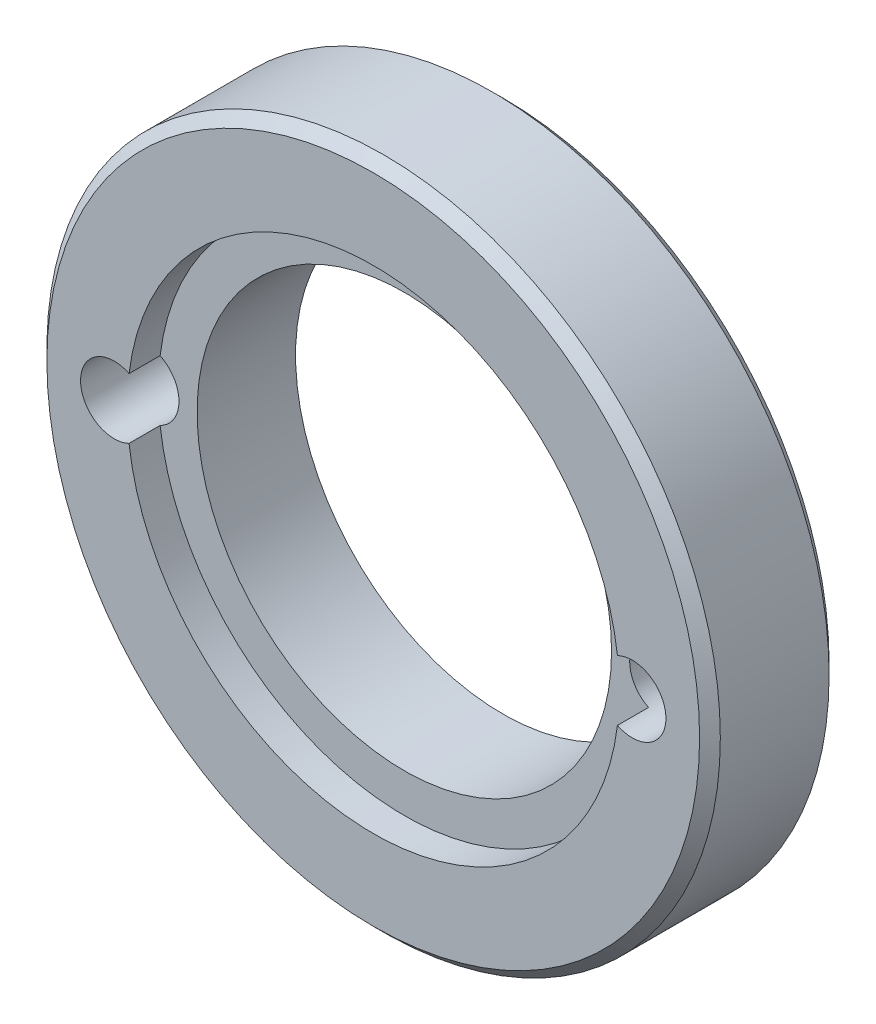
ISO-10303-21;
HEADER;
FILE_DESCRIPTION(('STEP AP214'),'2;1');
FILE_NAME('part.step','',(''),(''),'','','');
FILE_SCHEMA(('AUTOMOTIVE_DESIGN { 1 0 10303 214 1 1 1 1 }'));
ENDSEC;
DATA;
#1=APPLICATION_CONTEXT('core data for automotive mechanical design processes');
#2=APPLICATION_PROTOCOL_DEFINITION('international standard','automotive_design',2000,#1);
#3=PRODUCT_CONTEXT('',#1,'mechanical');
#4=PRODUCT('Part','Part','',(#3));
#5=PRODUCT_RELATED_PRODUCT_CATEGORY('part','',(#4));
#6=PRODUCT_DEFINITION_FORMATION('','',#4);
#7=PRODUCT_DEFINITION_CONTEXT('part definition',#1,'design');
#8=PRODUCT_DEFINITION('design','',#6,#7);
#9=PRODUCT_DEFINITION_SHAPE('','',#8);
#10=(LENGTH_UNIT() NAMED_UNIT(*) SI_UNIT(.MILLI.,.METRE.));
#11=(NAMED_UNIT(*) PLANE_ANGLE_UNIT() SI_UNIT($,.RADIAN.));
#12=(NAMED_UNIT(*) SI_UNIT($,.STERADIAN.) SOLID_ANGLE_UNIT());
#13=UNCERTAINTY_MEASURE_WITH_UNIT(LENGTH_MEASURE(1.E-05),#10,'distance_accuracy_value','');
#14=(GEOMETRIC_REPRESENTATION_CONTEXT(3) GLOBAL_UNCERTAINTY_ASSIGNED_CONTEXT((#13)) GLOBAL_UNIT_ASSIGNED_CONTEXT((#10,
#11,#12)) REPRESENTATION_CONTEXT('',''));
#15=CARTESIAN_POINT('',(0.,0.,0.));
#16=DIRECTION('',(0.,0.,1.));
#17=DIRECTION('',(1.,0.,0.));
#18=AXIS2_PLACEMENT_3D('',#15,#16,#17);
#19=CARTESIAN_POINT('',(0.,0.,5.));
#20=DIRECTION('',(0.,0.,-1.));
#21=DIRECTION('',(-1.,0.,0.));
#22=AXIS2_PLACEMENT_3D('',#19,#20,#21);
#23=CYLINDRICAL_SURFACE('',#22,9.5);
#24=CARTESIAN_POINT('',(0.,0.,3.8));
#25=DIRECTION('',(0.,0.,-1.));
#26=DIRECTION('',(-1.,0.,0.));
#27=AXIS2_PLACEMENT_3D('',#24,#25,#26);
#28=CIRCLE('',#27,9.5);
#29=CARTESIAN_POINT('',(9.42800000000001,-1.16739710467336,3.8));
#30=VERTEX_POINT('',#29);
#31=CARTESIAN_POINT('',(-9.42800000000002,-1.16739710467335,3.8));
#32=VERTEX_POINT('',#31);
#33=EDGE_CURVE('E77',#30,#32,#28,.T.);
#34=ORIENTED_EDGE('',*,*,#33,.T.);
#35=DIRECTION('',(0.,0.,-1.));
#36=VECTOR('',#35,1.);
#37=CARTESIAN_POINT('',(-9.42800000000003,-1.16739710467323,5.));
#38=LINE('',#37,#36);
#39=CARTESIAN_POINT('',(-9.42800000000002,-1.16739710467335,5.));
#40=VERTEX_POINT('',#39);
#41=EDGE_CURVE('E70',#40,#32,#38,.T.);
#42=ORIENTED_EDGE('',*,*,#41,.F.);
#43=CARTESIAN_POINT('',(0.,0.,5.));
#44=DIRECTION('',(0.,0.,-1.));
#45=DIRECTION('',(-1.,0.,0.));
#46=AXIS2_PLACEMENT_3D('',#43,#44,#45);
#47=CIRCLE('',#46,9.5);
#48=CARTESIAN_POINT('',(9.42800000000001,-1.16739710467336,5.));
#49=VERTEX_POINT('',#48);
#50=EDGE_CURVE('E19',#49,#40,#47,.T.);
#51=ORIENTED_EDGE('',*,*,#50,.F.);
#52=DIRECTION('',(0.,0.,-1.));
#53=VECTOR('',#52,1.);
#54=CARTESIAN_POINT('',(9.42800000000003,-1.16739710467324,5.));
#55=LINE('',#54,#53);
#56=EDGE_CURVE('E78',#30,#49,#55,.F.);
#57=ORIENTED_EDGE('',*,*,#56,.F.);
#58=EDGE_LOOP('',(#34,#42,#51,#57));
#59=FACE_BOUND('',#58,.T.);
#60=ADVANCED_FACE('F16',(#59),#23,.F.);
#61=CARTESIAN_POINT('',(0.,0.,5.));
#62=DIRECTION('',(0.,0.,-1.));
#63=DIRECTION('',(-1.,0.,0.));
#64=AXIS2_PLACEMENT_3D('',#61,#62,#63);
#65=CYLINDRICAL_SURFACE('',#64,9.5);
#66=CARTESIAN_POINT('',(0.,0.,5.));
#67=DIRECTION('',(0.,0.,-1.));
#68=DIRECTION('',(-1.,0.,0.));
#69=AXIS2_PLACEMENT_3D('',#66,#67,#68);
#70=CIRCLE('',#69,9.5);
#71=CARTESIAN_POINT('',(-9.42800000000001,1.16739710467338,5.));
#72=VERTEX_POINT('',#71);
#73=CARTESIAN_POINT('',(9.42800000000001,1.16739710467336,5.));
#74=VERTEX_POINT('',#73);
#75=EDGE_CURVE('E81',#72,#74,#70,.T.);
#76=ORIENTED_EDGE('',*,*,#75,.F.);
#77=DIRECTION('',(0.,0.,-1.));
#78=VECTOR('',#77,1.);
#79=CARTESIAN_POINT('',(-9.42800000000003,1.16739710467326,5.));
#80=LINE('',#79,#78);
#81=CARTESIAN_POINT('',(-9.42800000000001,1.16739710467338,3.8));
#82=VERTEX_POINT('',#81);
#83=EDGE_CURVE('E54',#82,#72,#80,.F.);
#84=ORIENTED_EDGE('',*,*,#83,.F.);
#85=CARTESIAN_POINT('',(0.,0.,3.8));
#86=DIRECTION('',(0.,0.,-1.));
#87=DIRECTION('',(-1.,0.,0.));
#88=AXIS2_PLACEMENT_3D('',#85,#86,#87);
#89=CIRCLE('',#88,9.5);
#90=CARTESIAN_POINT('',(9.42800000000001,1.16739710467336,3.8));
#91=VERTEX_POINT('',#90);
#92=EDGE_CURVE('E107',#82,#91,#89,.T.);
#93=ORIENTED_EDGE('',*,*,#92,.T.);
#94=DIRECTION('',(0.,0.,-1.));
#95=VECTOR('',#94,1.);
#96=CARTESIAN_POINT('',(9.42800000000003,1.16739710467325,5.));
#97=LINE('',#96,#95);
#98=EDGE_CURVE('E34',#74,#91,#97,.T.);
#99=ORIENTED_EDGE('',*,*,#98,.F.);
#100=EDGE_LOOP('',(#76,#84,#93,#99));
#101=FACE_BOUND('',#100,.T.);
#102=ADVANCED_FACE('F116',(#101),#65,.F.);
#103=CARTESIAN_POINT('',(0.,0.,4.59999999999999));
#104=DIRECTION('',(0.,0.,-1.));
#105=DIRECTION('',(0.,1.,0.));
#106=AXIS2_PLACEMENT_3D('',#103,#104,#105);
#107=CONICAL_SURFACE('',#106,12.9999999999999,0.785398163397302);
#108=CARTESIAN_POINT('',(0.,0.,4.59999999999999));
#109=DIRECTION('',(0.,0.,1.));
#110=DIRECTION('',(1.,0.,0.));
#111=AXIS2_PLACEMENT_3D('',#108,#109,#110);
#112=CIRCLE('',#111,13.);
#113=CARTESIAN_POINT('',(13.,0.,4.59999999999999));
#114=VERTEX_POINT('',#113);
#115=EDGE_CURVE('E72',#114,#114,#112,.F.);
#116=ORIENTED_EDGE('',*,*,#115,.F.);
#117=EDGE_LOOP('',(#116));
#118=FACE_BOUND('',#117,.T.);
#119=CARTESIAN_POINT('',(0.,0.,5.00000000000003));
#120=DIRECTION('',(0.,0.,-1.));
#121=DIRECTION('',(0.,1.,0.));
#122=AXIS2_PLACEMENT_3D('',#119,#120,#121);
#123=CIRCLE('',#122,12.6);
#124=CARTESIAN_POINT('',(0.,12.6,5.00000000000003));
#125=VERTEX_POINT('',#124);
#126=EDGE_CURVE('E82',#125,#125,#123,.F.);
#127=ORIENTED_EDGE('',*,*,#126,.F.);
#128=EDGE_LOOP('',(#127));
#129=FACE_BOUND('',#128,.T.);
#130=ADVANCED_FACE('F114',(#118,#129),#107,.T.);
#131=CARTESIAN_POINT('',(0.,0.,5.));
#132=DIRECTION('',(0.,0.,1.));
#133=DIRECTION('',(1.,0.,0.));
#134=AXIS2_PLACEMENT_3D('',#131,#132,#133);
#135=PLANE('',#134);
#136=ORIENTED_EDGE('',*,*,#126,.T.);
#137=EDGE_LOOP('',(#136));
#138=FACE_BOUND('',#137,.T.);
#139=CARTESIAN_POINT('',(10.,0.,5.));
#140=DIRECTION('',(0.,0.,-1.));
#141=DIRECTION('',(-1.,0.,0.));
#142=AXIS2_PLACEMENT_3D('',#139,#140,#141);
#143=CIRCLE('',#142,1.3);
#144=EDGE_CURVE('E47',#74,#49,#143,.T.);
#145=ORIENTED_EDGE('',*,*,#144,.T.);
#146=ORIENTED_EDGE('',*,*,#50,.T.);
#147=CARTESIAN_POINT('',(-10.,0.,5.));
#148=DIRECTION('',(0.,0.,-1.));
#149=DIRECTION('',(-1.,0.,0.));
#150=AXIS2_PLACEMENT_3D('',#147,#148,#149);
#151=CIRCLE('',#150,1.3);
#152=EDGE_CURVE('E66',#40,#72,#151,.T.);
#153=ORIENTED_EDGE('',*,*,#152,.T.);
#154=ORIENTED_EDGE('',*,*,#75,.T.);
#155=EDGE_LOOP('',(#145,#146,#153,#154));
#156=FACE_BOUND('',#155,.T.);
#157=ADVANCED_FACE('F80',(#138,#156),#135,.T.);
#158=CARTESIAN_POINT('',(0.,0.,3.8));
#159=DIRECTION('',(0.,0.,-1.));
#160=DIRECTION('',(-1.,0.,0.));
#161=AXIS2_PLACEMENT_3D('',#158,#159,#160);
#162=PLANE('',#161);
#163=ORIENTED_EDGE('',*,*,#92,.F.);
#164=CARTESIAN_POINT('',(-10.,0.,3.8));
#165=DIRECTION('',(0.,0.,-1.));
#166=DIRECTION('',(-1.,0.,0.));
#167=AXIS2_PLACEMENT_3D('',#164,#165,#166);
#168=CIRCLE('',#167,1.3);
#169=EDGE_CURVE('E61',#82,#32,#168,.T.);
#170=ORIENTED_EDGE('',*,*,#169,.T.);
#171=ORIENTED_EDGE('',*,*,#33,.F.);
#172=CARTESIAN_POINT('',(10.,0.,3.8));
#173=DIRECTION('',(0.,0.,-1.));
#174=DIRECTION('',(-1.,0.,0.));
#175=AXIS2_PLACEMENT_3D('',#172,#173,#174);
#176=CIRCLE('',#175,1.3);
#177=EDGE_CURVE('E103',#30,#91,#176,.T.);
#178=ORIENTED_EDGE('',*,*,#177,.T.);
#179=EDGE_LOOP('',(#163,#170,#171,#178));
#180=FACE_BOUND('',#179,.T.);
#181=CARTESIAN_POINT('',(0.,0.,3.8));
#182=DIRECTION('',(0.,0.,1.));
#183=DIRECTION('',(1.,0.,0.));
#184=AXIS2_PLACEMENT_3D('',#181,#182,#183);
#185=CIRCLE('',#184,8.);
#186=CARTESIAN_POINT('',(8.,0.,3.8));
#187=VERTEX_POINT('',#186);
#188=EDGE_CURVE('E99',#187,#187,#185,.F.);
#189=ORIENTED_EDGE('',*,*,#188,.T.);
#190=EDGE_LOOP('',(#189));
#191=FACE_BOUND('',#190,.T.);
#192=ADVANCED_FACE('F124',(#180,#191),#162,.F.);
#193=CARTESIAN_POINT('',(0.,0.,0.));
#194=DIRECTION('',(0.,0.,1.));
#195=DIRECTION('',(1.,0.,0.));
#196=AXIS2_PLACEMENT_3D('',#193,#194,#195);
#197=CYLINDRICAL_SURFACE('',#196,13.);
#198=ORIENTED_EDGE('',*,*,#115,.T.);
#199=EDGE_LOOP('',(#198));
#200=FACE_BOUND('',#199,.T.);
#201=CARTESIAN_POINT('',(0.,0.,0.400000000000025));
#202=DIRECTION('',(0.,0.,1.));
#203=DIRECTION('',(1.,0.,0.));
#204=AXIS2_PLACEMENT_3D('',#201,#202,#203);
#205=CIRCLE('',#204,13.);
#206=CARTESIAN_POINT('',(13.,0.,0.400000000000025));
#207=VERTEX_POINT('',#206);
#208=EDGE_CURVE('E98',#207,#207,#205,.F.);
#209=ORIENTED_EDGE('',*,*,#208,.F.);
#210=EDGE_LOOP('',(#209));
#211=FACE_BOUND('',#210,.T.);
#212=ADVANCED_FACE('F149',(#200,#211),#197,.T.);
#213=CARTESIAN_POINT('',(-10.,0.,7.120174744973));
#214=DIRECTION('',(0.,0.,-1.));
#215=DIRECTION('',(-1.,0.,0.));
#216=AXIS2_PLACEMENT_3D('',#213,#214,#215);
#217=CYLINDRICAL_SURFACE('',#216,1.3);
#218=ORIENTED_EDGE('',*,*,#152,.F.);
#219=ORIENTED_EDGE('',*,*,#41,.T.);
#220=ORIENTED_EDGE('',*,*,#169,.F.);
#221=ORIENTED_EDGE('',*,*,#83,.T.);
#222=EDGE_LOOP('',(#218,#219,#220,#221));
#223=FACE_BOUND('',#222,.T.);
#224=CARTESIAN_POINT('',(-10.,0.,0.));
#225=DIRECTION('',(0.,0.,-1.));
#226=DIRECTION('',(-1.,0.,0.));
#227=AXIS2_PLACEMENT_3D('',#224,#225,#226);
#228=CIRCLE('',#227,1.3);
#229=CARTESIAN_POINT('',(-11.3,0.,0.));
#230=VERTEX_POINT('',#229);
#231=EDGE_CURVE('E95',#230,#230,#228,.T.);
#232=ORIENTED_EDGE('',*,*,#231,.T.);
#233=EDGE_LOOP('',(#232));
#234=FACE_BOUND('',#233,.T.);
#235=ADVANCED_FACE('F68',(#223,#234),#217,.F.);
#236=CARTESIAN_POINT('',(10.,0.,7.120174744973));
#237=DIRECTION('',(0.,0.,-1.));
#238=DIRECTION('',(-1.,0.,0.));
#239=AXIS2_PLACEMENT_3D('',#236,#237,#238);
#240=CYLINDRICAL_SURFACE('',#239,1.3);
#241=ORIENTED_EDGE('',*,*,#177,.F.);
#242=ORIENTED_EDGE('',*,*,#56,.T.);
#243=ORIENTED_EDGE('',*,*,#144,.F.);
#244=ORIENTED_EDGE('',*,*,#98,.T.);
#245=EDGE_LOOP('',(#241,#242,#243,#244));
#246=FACE_BOUND('',#245,.T.);
#247=CARTESIAN_POINT('',(10.,0.,0.));
#248=DIRECTION('',(0.,0.,-1.));
#249=DIRECTION('',(-1.,0.,0.));
#250=AXIS2_PLACEMENT_3D('',#247,#248,#249);
#251=CIRCLE('',#250,1.3);
#252=CARTESIAN_POINT('',(8.70000000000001,0.,0.));
#253=VERTEX_POINT('',#252);
#254=EDGE_CURVE('E92',#253,#253,#251,.T.);
#255=ORIENTED_EDGE('',*,*,#254,.T.);
#256=EDGE_LOOP('',(#255));
#257=FACE_BOUND('',#256,.T.);
#258=ADVANCED_FACE('F143',(#246,#257),#240,.F.);
#259=CARTESIAN_POINT('',(0.,0.,0.));
#260=DIRECTION('',(0.,0.,1.));
#261=DIRECTION('',(1.,0.,0.));
#262=AXIS2_PLACEMENT_3D('',#259,#260,#261);
#263=CYLINDRICAL_SURFACE('',#262,8.);
#264=ORIENTED_EDGE('',*,*,#188,.F.);
#265=EDGE_LOOP('',(#264));
#266=FACE_BOUND('',#265,.T.);
#267=CARTESIAN_POINT('',(0.,0.,0.));
#268=DIRECTION('',(0.,0.,1.));
#269=DIRECTION('',(1.,0.,0.));
#270=AXIS2_PLACEMENT_3D('',#267,#268,#269);
#271=CIRCLE('',#270,8.);
#272=CARTESIAN_POINT('',(8.,0.,0.));
#273=VERTEX_POINT('',#272);
#274=EDGE_CURVE('E25',#273,#273,#271,.F.);
#275=ORIENTED_EDGE('',*,*,#274,.T.);
#276=EDGE_LOOP('',(#275));
#277=FACE_BOUND('',#276,.T.);
#278=ADVANCED_FACE('F135',(#266,#277),#263,.F.);
#279=CARTESIAN_POINT('',(0.,0.,0.400000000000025));
#280=DIRECTION('',(0.,0.,1.));
#281=DIRECTION('',(1.,0.,0.));
#282=AXIS2_PLACEMENT_3D('',#279,#280,#281);
#283=CONICAL_SURFACE('',#282,13.,0.785398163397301);
#284=ORIENTED_EDGE('',*,*,#208,.T.);
#285=EDGE_LOOP('',(#284));
#286=FACE_BOUND('',#285,.T.);
#287=CARTESIAN_POINT('',(0.,0.,0.));
#288=DIRECTION('',(0.,0.,1.));
#289=DIRECTION('',(1.,0.,0.));
#290=AXIS2_PLACEMENT_3D('',#287,#288,#289);
#291=CIRCLE('',#290,12.6);
#292=CARTESIAN_POINT('',(12.6,0.,0.));
#293=VERTEX_POINT('',#292);
#294=EDGE_CURVE('E11',#293,#293,#291,.T.);
#295=ORIENTED_EDGE('',*,*,#294,.T.);
#296=EDGE_LOOP('',(#295));
#297=FACE_BOUND('',#296,.T.);
#298=ADVANCED_FACE('F129',(#286,#297),#283,.T.);
#299=CARTESIAN_POINT('',(0.,0.,0.));
#300=DIRECTION('',(0.,0.,1.));
#301=DIRECTION('',(1.,0.,0.));
#302=AXIS2_PLACEMENT_3D('',#299,#300,#301);
#303=PLANE('',#302);
#304=ORIENTED_EDGE('',*,*,#294,.F.);
#305=EDGE_LOOP('',(#304));
#306=FACE_BOUND('',#305,.T.);
#307=ORIENTED_EDGE('',*,*,#274,.F.);
#308=EDGE_LOOP('',(#307));
#309=FACE_BOUND('',#308,.T.);
#310=ORIENTED_EDGE('',*,*,#254,.F.);
#311=EDGE_LOOP('',(#310));
#312=FACE_BOUND('',#311,.T.);
#313=ORIENTED_EDGE('',*,*,#231,.F.);
#314=EDGE_LOOP('',(#313));
#315=FACE_BOUND('',#314,.T.);
#316=ADVANCED_FACE('F127',(#306,#309,#312,#315),#303,.F.);
#317=CLOSED_SHELL('',(#60,#102,#130,#157,#192,#212,#235,#258,#278,#298,#316));
#318=MANIFOLD_SOLID_BREP('B1',#317);
#319=ADVANCED_BREP_SHAPE_REPRESENTATION('',(#18,#318),#14);
#320=SHAPE_DEFINITION_REPRESENTATION(#9,#319);
ENDSEC;
END-ISO-10303-21;
